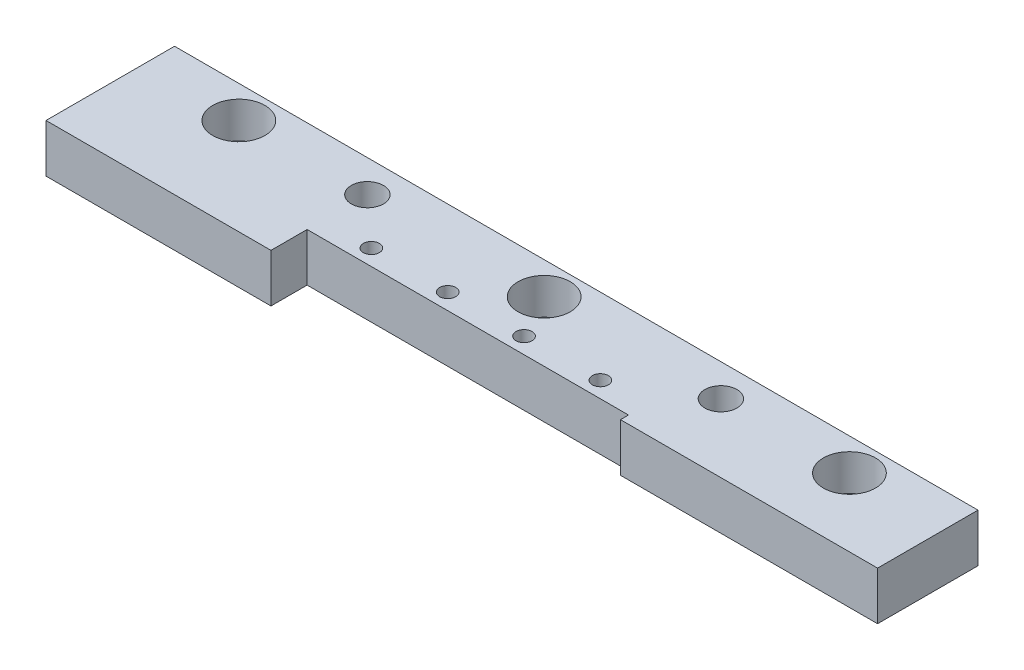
ISO-10303-21;
HEADER;
FILE_DESCRIPTION(('STEP AP214'),'2;1');
FILE_NAME('part.step','',(''),(''),'','','');
FILE_SCHEMA(('AUTOMOTIVE_DESIGN { 1 0 10303 214 1 1 1 1 }'));
ENDSEC;
DATA;
#1=APPLICATION_CONTEXT('core data for automotive mechanical design processes');
#2=APPLICATION_PROTOCOL_DEFINITION('international standard','automotive_design',2000,#1);
#3=PRODUCT_CONTEXT('',#1,'mechanical');
#4=PRODUCT('Part','Part','',(#3));
#5=PRODUCT_RELATED_PRODUCT_CATEGORY('part','',(#4));
#6=PRODUCT_DEFINITION_FORMATION('','',#4);
#7=PRODUCT_DEFINITION_CONTEXT('part definition',#1,'design');
#8=PRODUCT_DEFINITION('design','',#6,#7);
#9=PRODUCT_DEFINITION_SHAPE('','',#8);
#10=(LENGTH_UNIT() NAMED_UNIT(*) SI_UNIT(.MILLI.,.METRE.));
#11=(NAMED_UNIT(*) PLANE_ANGLE_UNIT() SI_UNIT($,.RADIAN.));
#12=(NAMED_UNIT(*) SI_UNIT($,.STERADIAN.) SOLID_ANGLE_UNIT());
#13=UNCERTAINTY_MEASURE_WITH_UNIT(LENGTH_MEASURE(1.E-05),#10,'distance_accuracy_value','');
#14=(GEOMETRIC_REPRESENTATION_CONTEXT(3) GLOBAL_UNCERTAINTY_ASSIGNED_CONTEXT((#13)) GLOBAL_UNIT_ASSIGNED_CONTEXT((#10,
#11,#12)) REPRESENTATION_CONTEXT('',''));
#15=CARTESIAN_POINT('',(0.,0.,0.));
#16=DIRECTION('',(0.,0.,1.));
#17=DIRECTION('',(1.,0.,0.));
#18=AXIS2_PLACEMENT_3D('',#15,#16,#17);
#19=CARTESIAN_POINT('',(50.,-10.,4.));
#20=DIRECTION('',(0.,1.,0.));
#21=DIRECTION('',(0.,0.,1.));
#22=AXIS2_PLACEMENT_3D('',#19,#20,#21);
#23=CYLINDRICAL_SURFACE('',#22,1.75);
#24=CARTESIAN_POINT('',(50.,0.,4.));
#25=DIRECTION('',(0.,1.,0.));
#26=DIRECTION('',(0.,0.,1.));
#27=AXIS2_PLACEMENT_3D('',#24,#25,#26);
#28=CIRCLE('',#27,1.75);
#29=CARTESIAN_POINT('',(50.,0.,5.75));
#30=VERTEX_POINT('',#29);
#31=EDGE_CURVE('E182',#30,#30,#28,.T.);
#32=ORIENTED_EDGE('',*,*,#31,.F.);
#33=EDGE_LOOP('',(#32));
#34=FACE_BOUND('',#33,.T.);
#35=CARTESIAN_POINT('',(50.,1.5,4.));
#36=DIRECTION('',(0.,1.,0.));
#37=DIRECTION('',(0.,0.,1.));
#38=AXIS2_PLACEMENT_3D('',#35,#36,#37);
#39=CIRCLE('',#38,1.75);
#40=CARTESIAN_POINT('',(50.,1.5,5.75));
#41=VERTEX_POINT('',#40);
#42=EDGE_CURVE('E37',#41,#41,#39,.F.);
#43=ORIENTED_EDGE('',*,*,#42,.F.);
#44=EDGE_LOOP('',(#43));
#45=FACE_BOUND('',#44,.T.);
#46=ADVANCED_FACE('F33',(#34,#45),#23,.F.);
#47=CARTESIAN_POINT('',(88.,-10.,4.));
#48=DIRECTION('',(0.,1.,0.));
#49=DIRECTION('',(0.,0.,1.));
#50=AXIS2_PLACEMENT_3D('',#47,#48,#49);
#51=CYLINDRICAL_SURFACE('',#50,1.75);
#52=CARTESIAN_POINT('',(88.,0.,4.));
#53=DIRECTION('',(0.,1.,0.));
#54=DIRECTION('',(0.,0.,1.));
#55=AXIS2_PLACEMENT_3D('',#52,#53,#54);
#56=CIRCLE('',#55,1.75);
#57=CARTESIAN_POINT('',(88.,0.,5.75));
#58=VERTEX_POINT('',#57);
#59=EDGE_CURVE('E185',#58,#58,#56,.T.);
#60=ORIENTED_EDGE('',*,*,#59,.F.);
#61=EDGE_LOOP('',(#60));
#62=FACE_BOUND('',#61,.T.);
#63=CARTESIAN_POINT('',(88.,1.5,4.));
#64=DIRECTION('',(0.,1.,0.));
#65=DIRECTION('',(0.,0.,1.));
#66=AXIS2_PLACEMENT_3D('',#63,#64,#65);
#67=CIRCLE('',#66,1.75);
#68=CARTESIAN_POINT('',(88.,1.5,5.75));
#69=VERTEX_POINT('',#68);
#70=EDGE_CURVE('E117',#69,#69,#67,.F.);
#71=ORIENTED_EDGE('',*,*,#70,.F.);
#72=EDGE_LOOP('',(#71));
#73=FACE_BOUND('',#72,.T.);
#74=ADVANCED_FACE('F264',(#62,#73),#51,.F.);
#75=CARTESIAN_POINT('',(12.,-10.,4.));
#76=DIRECTION('',(0.,1.,0.));
#77=DIRECTION('',(0.,0.,1.));
#78=AXIS2_PLACEMENT_3D('',#75,#76,#77);
#79=CYLINDRICAL_SURFACE('',#78,1.75);
#80=CARTESIAN_POINT('',(12.,0.,4.));
#81=DIRECTION('',(0.,1.,0.));
#82=DIRECTION('',(0.,0.,1.));
#83=AXIS2_PLACEMENT_3D('',#80,#81,#82);
#84=CIRCLE('',#83,1.75);
#85=CARTESIAN_POINT('',(12.,0.,5.75));
#86=VERTEX_POINT('',#85);
#87=EDGE_CURVE('E188',#86,#86,#84,.T.);
#88=ORIENTED_EDGE('',*,*,#87,.F.);
#89=EDGE_LOOP('',(#88));
#90=FACE_BOUND('',#89,.T.);
#91=CARTESIAN_POINT('',(12.,1.5,4.));
#92=DIRECTION('',(0.,1.,0.));
#93=DIRECTION('',(0.,0.,1.));
#94=AXIS2_PLACEMENT_3D('',#91,#92,#93);
#95=CIRCLE('',#94,1.75);
#96=CARTESIAN_POINT('',(12.,1.5,5.75));
#97=VERTEX_POINT('',#96);
#98=EDGE_CURVE('E114',#97,#97,#95,.F.);
#99=ORIENTED_EDGE('',*,*,#98,.F.);
#100=EDGE_LOOP('',(#99));
#101=FACE_BOUND('',#100,.T.);
#102=ADVANCED_FACE('F261',(#90,#101),#79,.F.);
#103=CARTESIAN_POINT('',(0.,0.,16.));
#104=DIRECTION('',(0.,1.,0.));
#105=DIRECTION('',(0.,0.,1.));
#106=AXIS2_PLACEMENT_3D('',#103,#104,#105);
#107=PLANE('',#106);
#108=CARTESIAN_POINT('',(62.5,0.,9.5));
#109=DIRECTION('',(0.,1.,0.));
#110=DIRECTION('',(0.,0.,1.));
#111=AXIS2_PLACEMENT_3D('',#108,#109,#110);
#112=CIRCLE('',#111,1.);
#113=CARTESIAN_POINT('',(62.5,0.,10.5));
#114=VERTEX_POINT('',#113);
#115=EDGE_CURVE('E100',#114,#114,#112,.T.);
#116=ORIENTED_EDGE('',*,*,#115,.T.);
#117=EDGE_LOOP('',(#116));
#118=FACE_BOUND('',#117,.T.);
#119=CARTESIAN_POINT('',(53.,0.,9.5));
#120=DIRECTION('',(0.,1.,0.));
#121=DIRECTION('',(0.,0.,1.));
#122=AXIS2_PLACEMENT_3D('',#119,#120,#121);
#123=CIRCLE('',#122,1.);
#124=CARTESIAN_POINT('',(53.,0.,10.5));
#125=VERTEX_POINT('',#124);
#126=EDGE_CURVE('E206',#125,#125,#123,.T.);
#127=ORIENTED_EDGE('',*,*,#126,.T.);
#128=EDGE_LOOP('',(#127));
#129=FACE_BOUND('',#128,.T.);
#130=CARTESIAN_POINT('',(43.5,0.,9.5));
#131=DIRECTION('',(0.,1.,0.));
#132=DIRECTION('',(0.,0.,1.));
#133=AXIS2_PLACEMENT_3D('',#130,#131,#132);
#134=CIRCLE('',#133,1.);
#135=CARTESIAN_POINT('',(43.5,0.,10.5));
#136=VERTEX_POINT('',#135);
#137=EDGE_CURVE('E200',#136,#136,#134,.T.);
#138=ORIENTED_EDGE('',*,*,#137,.T.);
#139=EDGE_LOOP('',(#138));
#140=FACE_BOUND('',#139,.T.);
#141=CARTESIAN_POINT('',(34.,0.,9.5));
#142=DIRECTION('',(0.,1.,0.));
#143=DIRECTION('',(0.,0.,1.));
#144=AXIS2_PLACEMENT_3D('',#141,#142,#143);
#145=CIRCLE('',#144,1.);
#146=CARTESIAN_POINT('',(34.,0.,10.5));
#147=VERTEX_POINT('',#146);
#148=EDGE_CURVE('E194',#147,#147,#145,.T.);
#149=ORIENTED_EDGE('',*,*,#148,.T.);
#150=EDGE_LOOP('',(#149));
#151=FACE_BOUND('',#150,.T.);
#152=ORIENTED_EDGE('',*,*,#87,.T.);
#153=EDGE_LOOP('',(#152));
#154=FACE_BOUND('',#153,.T.);
#155=ORIENTED_EDGE('',*,*,#59,.T.);
#156=EDGE_LOOP('',(#155));
#157=FACE_BOUND('',#156,.T.);
#158=ORIENTED_EDGE('',*,*,#31,.T.);
#159=EDGE_LOOP('',(#158));
#160=FACE_BOUND('',#159,.T.);
#161=CARTESIAN_POINT('',(28.,0.,4.));
#162=DIRECTION('',(0.,1.,0.));
#163=DIRECTION('',(0.,0.,1.));
#164=AXIS2_PLACEMENT_3D('',#161,#162,#163);
#165=CIRCLE('',#164,2.);
#166=CARTESIAN_POINT('',(28.,0.,6.));
#167=VERTEX_POINT('',#166);
#168=EDGE_CURVE('E179',#167,#167,#165,.T.);
#169=ORIENTED_EDGE('',*,*,#168,.T.);
#170=EDGE_LOOP('',(#169));
#171=FACE_BOUND('',#170,.T.);
#172=CARTESIAN_POINT('',(72.,0.,4.));
#173=DIRECTION('',(0.,1.,0.));
#174=DIRECTION('',(0.,0.,1.));
#175=AXIS2_PLACEMENT_3D('',#172,#173,#174);
#176=CIRCLE('',#175,2.);
#177=CARTESIAN_POINT('',(72.,0.,6.));
#178=VERTEX_POINT('',#177);
#179=EDGE_CURVE('E173',#178,#178,#176,.T.);
#180=ORIENTED_EDGE('',*,*,#179,.T.);
#181=EDGE_LOOP('',(#180));
#182=FACE_BOUND('',#181,.T.);
#183=DIRECTION('',(1.,0.,0.));
#184=VECTOR('',#183,1.);
#185=CARTESIAN_POINT('',(0.,0.,12.5));
#186=LINE('',#185,#184);
#187=CARTESIAN_POINT('',(68.,0.,12.5));
#188=VERTEX_POINT('',#187);
#189=CARTESIAN_POINT('',(100.,0.,12.5));
#190=VERTEX_POINT('',#189);
#191=EDGE_CURVE('E167',#188,#190,#186,.T.);
#192=ORIENTED_EDGE('',*,*,#191,.F.);
#193=DIRECTION('',(0.,0.,1.));
#194=VECTOR('',#193,1.);
#195=CARTESIAN_POINT('',(68.,0.,16.));
#196=LINE('',#195,#194);
#197=CARTESIAN_POINT('',(68.,0.,11.5));
#198=VERTEX_POINT('',#197);
#199=EDGE_CURVE('E164',#198,#188,#196,.T.);
#200=ORIENTED_EDGE('',*,*,#199,.F.);
#201=DIRECTION('',(1.,0.,0.));
#202=VECTOR('',#201,1.);
#203=CARTESIAN_POINT('',(0.,0.,11.5));
#204=LINE('',#203,#202);
#205=CARTESIAN_POINT('',(28.,0.,11.5));
#206=VERTEX_POINT('',#205);
#207=EDGE_CURVE('E161',#206,#198,#204,.T.);
#208=ORIENTED_EDGE('',*,*,#207,.F.);
#209=DIRECTION('',(0.,0.,-1.));
#210=VECTOR('',#209,1.);
#211=CARTESIAN_POINT('',(28.,0.,16.));
#212=LINE('',#211,#210);
#213=CARTESIAN_POINT('',(28.,0.,16.));
#214=VERTEX_POINT('',#213);
#215=EDGE_CURVE('E151',#214,#206,#212,.T.);
#216=ORIENTED_EDGE('',*,*,#215,.F.);
#217=DIRECTION('',(1.,0.,0.));
#218=VECTOR('',#217,1.);
#219=CARTESIAN_POINT('',(0.,0.,16.));
#220=LINE('',#219,#218);
#221=CARTESIAN_POINT('',(0.,0.,16.));
#222=VERTEX_POINT('',#221);
#223=EDGE_CURVE('E211',#222,#214,#220,.T.);
#224=ORIENTED_EDGE('',*,*,#223,.F.);
#225=DIRECTION('',(0.,0.,-1.));
#226=VECTOR('',#225,1.);
#227=CARTESIAN_POINT('',(0.,0.,16.));
#228=LINE('',#227,#226);
#229=CARTESIAN_POINT('',(0.,0.,0.));
#230=VERTEX_POINT('',#229);
#231=EDGE_CURVE('E42',#222,#230,#228,.T.);
#232=ORIENTED_EDGE('',*,*,#231,.T.);
#233=DIRECTION('',(1.,0.,0.));
#234=VECTOR('',#233,1.);
#235=CARTESIAN_POINT('',(0.,0.,0.));
#236=LINE('',#235,#234);
#237=CARTESIAN_POINT('',(100.,0.,0.));
#238=VERTEX_POINT('',#237);
#239=EDGE_CURVE('E98',#230,#238,#236,.T.);
#240=ORIENTED_EDGE('',*,*,#239,.T.);
#241=DIRECTION('',(0.,0.,-1.));
#242=VECTOR('',#241,1.);
#243=CARTESIAN_POINT('',(100.,0.,16.));
#244=LINE('',#243,#242);
#245=EDGE_CURVE('E111',#190,#238,#244,.T.);
#246=ORIENTED_EDGE('',*,*,#245,.F.);
#247=EDGE_LOOP('',(#192,#200,#208,#216,#224,#232,#240,#246));
#248=FACE_BOUND('',#247,.T.);
#249=ADVANCED_FACE('F221',(#118,#129,#140,#151,#154,#157,#160,#171,#182,#248),#107,.F.);
#250=CARTESIAN_POINT('',(100.,0.,16.));
#251=DIRECTION('',(-1.,0.,0.));
#252=DIRECTION('',(0.,0.,1.));
#253=AXIS2_PLACEMENT_3D('',#250,#251,#252);
#254=PLANE('',#253);
#255=DIRECTION('',(0.,1.,0.));
#256=VECTOR('',#255,1.);
#257=CARTESIAN_POINT('',(100.,-10.,12.5));
#258=LINE('',#257,#256);
#259=CARTESIAN_POINT('',(100.,6.,12.5));
#260=VERTEX_POINT('',#259);
#261=EDGE_CURVE('E148',#190,#260,#258,.T.);
#262=ORIENTED_EDGE('',*,*,#261,.F.);
#263=ORIENTED_EDGE('',*,*,#245,.T.);
#264=DIRECTION('',(0.,1.,0.));
#265=VECTOR('',#264,1.);
#266=CARTESIAN_POINT('',(100.,0.,0.));
#267=LINE('',#266,#265);
#268=CARTESIAN_POINT('',(100.,6.,0.));
#269=VERTEX_POINT('',#268);
#270=EDGE_CURVE('E89',#238,#269,#267,.T.);
#271=ORIENTED_EDGE('',*,*,#270,.T.);
#272=DIRECTION('',(0.,0.,-1.));
#273=VECTOR('',#272,1.);
#274=CARTESIAN_POINT('',(100.,6.,16.));
#275=LINE('',#274,#273);
#276=EDGE_CURVE('E83',#260,#269,#275,.T.);
#277=ORIENTED_EDGE('',*,*,#276,.F.);
#278=EDGE_LOOP('',(#262,#263,#271,#277));
#279=FACE_BOUND('',#278,.T.);
#280=ADVANCED_FACE('F252',(#279),#254,.F.);
#281=CARTESIAN_POINT('',(0.,6.,16.));
#282=DIRECTION('',(0.,-1.,0.));
#283=DIRECTION('',(0.,0.,-1.));
#284=AXIS2_PLACEMENT_3D('',#281,#282,#283);
#285=PLANE('',#284);
#286=CARTESIAN_POINT('',(50.,6.,4.));
#287=DIRECTION('',(0.,1.,0.));
#288=DIRECTION('',(0.,0.,1.));
#289=AXIS2_PLACEMENT_3D('',#286,#287,#288);
#290=CIRCLE('',#289,3.25);
#291=CARTESIAN_POINT('',(50.,6.,7.25));
#292=VERTEX_POINT('',#291);
#293=EDGE_CURVE('E133',#292,#292,#290,.T.);
#294=ORIENTED_EDGE('',*,*,#293,.F.);
#295=EDGE_LOOP('',(#294));
#296=FACE_BOUND('',#295,.T.);
#297=CARTESIAN_POINT('',(88.,6.,4.));
#298=DIRECTION('',(0.,1.,0.));
#299=DIRECTION('',(0.,0.,1.));
#300=AXIS2_PLACEMENT_3D('',#297,#298,#299);
#301=CIRCLE('',#300,3.25);
#302=CARTESIAN_POINT('',(88.,6.,7.25));
#303=VERTEX_POINT('',#302);
#304=EDGE_CURVE('E126',#303,#303,#301,.T.);
#305=ORIENTED_EDGE('',*,*,#304,.F.);
#306=EDGE_LOOP('',(#305));
#307=FACE_BOUND('',#306,.T.);
#308=CARTESIAN_POINT('',(12.,6.,4.));
#309=DIRECTION('',(0.,1.,0.));
#310=DIRECTION('',(0.,0.,1.));
#311=AXIS2_PLACEMENT_3D('',#308,#309,#310);
#312=CIRCLE('',#311,3.25);
#313=CARTESIAN_POINT('',(12.,6.,7.25));
#314=VERTEX_POINT('',#313);
#315=EDGE_CURVE('E119',#314,#314,#312,.T.);
#316=ORIENTED_EDGE('',*,*,#315,.F.);
#317=EDGE_LOOP('',(#316));
#318=FACE_BOUND('',#317,.T.);
#319=CARTESIAN_POINT('',(62.5,6.,9.5));
#320=DIRECTION('',(0.,1.,0.));
#321=DIRECTION('',(0.,0.,1.));
#322=AXIS2_PLACEMENT_3D('',#319,#320,#321);
#323=CIRCLE('',#322,1.);
#324=CARTESIAN_POINT('',(62.5,6.,10.5));
#325=VERTEX_POINT('',#324);
#326=EDGE_CURVE('E104',#325,#325,#323,.T.);
#327=ORIENTED_EDGE('',*,*,#326,.F.);
#328=EDGE_LOOP('',(#327));
#329=FACE_BOUND('',#328,.T.);
#330=CARTESIAN_POINT('',(53.,6.,9.5));
#331=DIRECTION('',(0.,1.,0.));
#332=DIRECTION('',(0.,0.,1.));
#333=AXIS2_PLACEMENT_3D('',#330,#331,#332);
#334=CIRCLE('',#333,1.);
#335=CARTESIAN_POINT('',(53.,6.,10.5));
#336=VERTEX_POINT('',#335);
#337=EDGE_CURVE('E203',#336,#336,#334,.T.);
#338=ORIENTED_EDGE('',*,*,#337,.F.);
#339=EDGE_LOOP('',(#338));
#340=FACE_BOUND('',#339,.T.);
#341=CARTESIAN_POINT('',(43.5,6.,9.5));
#342=DIRECTION('',(0.,1.,0.));
#343=DIRECTION('',(0.,0.,1.));
#344=AXIS2_PLACEMENT_3D('',#341,#342,#343);
#345=CIRCLE('',#344,1.);
#346=CARTESIAN_POINT('',(43.5,6.,10.5));
#347=VERTEX_POINT('',#346);
#348=EDGE_CURVE('E197',#347,#347,#345,.T.);
#349=ORIENTED_EDGE('',*,*,#348,.F.);
#350=EDGE_LOOP('',(#349));
#351=FACE_BOUND('',#350,.T.);
#352=CARTESIAN_POINT('',(34.,6.,9.5));
#353=DIRECTION('',(0.,1.,0.));
#354=DIRECTION('',(0.,0.,1.));
#355=AXIS2_PLACEMENT_3D('',#352,#353,#354);
#356=CIRCLE('',#355,1.);
#357=CARTESIAN_POINT('',(34.,6.,10.5));
#358=VERTEX_POINT('',#357);
#359=EDGE_CURVE('E191',#358,#358,#356,.T.);
#360=ORIENTED_EDGE('',*,*,#359,.F.);
#361=EDGE_LOOP('',(#360));
#362=FACE_BOUND('',#361,.T.);
#363=CARTESIAN_POINT('',(28.,6.,4.));
#364=DIRECTION('',(0.,1.,0.));
#365=DIRECTION('',(0.,0.,1.));
#366=AXIS2_PLACEMENT_3D('',#363,#364,#365);
#367=CIRCLE('',#366,2.);
#368=CARTESIAN_POINT('',(28.,6.,6.));
#369=VERTEX_POINT('',#368);
#370=EDGE_CURVE('E176',#369,#369,#367,.T.);
#371=ORIENTED_EDGE('',*,*,#370,.F.);
#372=EDGE_LOOP('',(#371));
#373=FACE_BOUND('',#372,.T.);
#374=CARTESIAN_POINT('',(72.,6.,4.));
#375=DIRECTION('',(0.,1.,0.));
#376=DIRECTION('',(0.,0.,1.));
#377=AXIS2_PLACEMENT_3D('',#374,#375,#376);
#378=CIRCLE('',#377,2.);
#379=CARTESIAN_POINT('',(72.,6.,6.));
#380=VERTEX_POINT('',#379);
#381=EDGE_CURVE('E170',#380,#380,#378,.T.);
#382=ORIENTED_EDGE('',*,*,#381,.F.);
#383=EDGE_LOOP('',(#382));
#384=FACE_BOUND('',#383,.T.);
#385=DIRECTION('',(1.,0.,0.));
#386=VECTOR('',#385,1.);
#387=CARTESIAN_POINT('',(68.,6.,12.5));
#388=LINE('',#387,#386);
#389=CARTESIAN_POINT('',(68.,6.,12.5));
#390=VERTEX_POINT('',#389);
#391=EDGE_CURVE('E145',#390,#260,#388,.T.);
#392=ORIENTED_EDGE('',*,*,#391,.T.);
#393=ORIENTED_EDGE('',*,*,#276,.T.);
#394=DIRECTION('',(-1.,0.,0.));
#395=VECTOR('',#394,1.);
#396=CARTESIAN_POINT('',(0.,6.,0.));
#397=LINE('',#396,#395);
#398=CARTESIAN_POINT('',(0.,6.,0.));
#399=VERTEX_POINT('',#398);
#400=EDGE_CURVE('E76',#269,#399,#397,.T.);
#401=ORIENTED_EDGE('',*,*,#400,.T.);
#402=DIRECTION('',(0.,0.,-1.));
#403=VECTOR('',#402,1.);
#404=CARTESIAN_POINT('',(0.,6.,16.));
#405=LINE('',#404,#403);
#406=CARTESIAN_POINT('',(0.,6.,16.));
#407=VERTEX_POINT('',#406);
#408=EDGE_CURVE('E80',#407,#399,#405,.T.);
#409=ORIENTED_EDGE('',*,*,#408,.F.);
#410=DIRECTION('',(-1.,0.,0.));
#411=VECTOR('',#410,1.);
#412=CARTESIAN_POINT('',(0.,6.,16.));
#413=LINE('',#412,#411);
#414=CARTESIAN_POINT('',(28.,6.,16.));
#415=VERTEX_POINT('',#414);
#416=EDGE_CURVE('E57',#415,#407,#413,.T.);
#417=ORIENTED_EDGE('',*,*,#416,.F.);
#418=DIRECTION('',(0.,0.,-1.));
#419=VECTOR('',#418,1.);
#420=CARTESIAN_POINT('',(28.,6.,16.));
#421=LINE('',#420,#419);
#422=CARTESIAN_POINT('',(28.,6.,11.5));
#423=VERTEX_POINT('',#422);
#424=EDGE_CURVE('E49',#415,#423,#421,.T.);
#425=ORIENTED_EDGE('',*,*,#424,.T.);
#426=DIRECTION('',(1.,0.,0.));
#427=VECTOR('',#426,1.);
#428=CARTESIAN_POINT('',(28.,6.,11.5));
#429=LINE('',#428,#427);
#430=CARTESIAN_POINT('',(68.,6.,11.5));
#431=VERTEX_POINT('',#430);
#432=EDGE_CURVE('E139',#423,#431,#429,.T.);
#433=ORIENTED_EDGE('',*,*,#432,.T.);
#434=DIRECTION('',(0.,0.,1.));
#435=VECTOR('',#434,1.);
#436=CARTESIAN_POINT('',(68.,6.,11.5));
#437=LINE('',#436,#435);
#438=EDGE_CURVE('E142',#431,#390,#437,.T.);
#439=ORIENTED_EDGE('',*,*,#438,.T.);
#440=EDGE_LOOP('',(#392,#393,#401,#409,#417,#425,#433,#439));
#441=FACE_BOUND('',#440,.T.);
#442=ADVANCED_FACE('F79',(#296,#307,#318,#329,#340,#351,#362,#373,#384,#441),#285,.F.);
#443=CARTESIAN_POINT('',(0.,6.,16.));
#444=DIRECTION('',(0.,0.,-1.));
#445=DIRECTION('',(-1.,0.,0.));
#446=AXIS2_PLACEMENT_3D('',#443,#444,#445);
#447=PLANE('',#446);
#448=DIRECTION('',(0.,-1.,0.));
#449=VECTOR('',#448,1.);
#450=CARTESIAN_POINT('',(28.,6.,16.));
#451=LINE('',#450,#449);
#452=EDGE_CURVE('E12',#415,#214,#451,.T.);
#453=ORIENTED_EDGE('',*,*,#452,.F.);
#454=ORIENTED_EDGE('',*,*,#416,.T.);
#455=DIRECTION('',(0.,-1.,0.));
#456=VECTOR('',#455,1.);
#457=CARTESIAN_POINT('',(0.,0.,16.));
#458=LINE('',#457,#456);
#459=EDGE_CURVE('E88',#407,#222,#458,.T.);
#460=ORIENTED_EDGE('',*,*,#459,.T.);
#461=ORIENTED_EDGE('',*,*,#223,.T.);
#462=EDGE_LOOP('',(#453,#454,#460,#461));
#463=FACE_BOUND('',#462,.T.);
#464=ADVANCED_FACE('F214',(#463),#447,.F.);
#465=CARTESIAN_POINT('',(0.,0.,16.));
#466=DIRECTION('',(1.,0.,0.));
#467=DIRECTION('',(0.,0.,-1.));
#468=AXIS2_PLACEMENT_3D('',#465,#466,#467);
#469=PLANE('',#468);
#470=DIRECTION('',(0.,-1.,0.));
#471=VECTOR('',#470,1.);
#472=CARTESIAN_POINT('',(0.,0.,0.));
#473=LINE('',#472,#471);
#474=EDGE_CURVE('E94',#399,#230,#473,.T.);
#475=ORIENTED_EDGE('',*,*,#474,.T.);
#476=ORIENTED_EDGE('',*,*,#231,.F.);
#477=ORIENTED_EDGE('',*,*,#459,.F.);
#478=ORIENTED_EDGE('',*,*,#408,.T.);
#479=EDGE_LOOP('',(#475,#476,#477,#478));
#480=FACE_BOUND('',#479,.T.);
#481=ADVANCED_FACE('F35',(#480),#469,.F.);
#482=CARTESIAN_POINT('',(0.,6.,0.));
#483=DIRECTION('',(0.,0.,-1.));
#484=DIRECTION('',(-1.,0.,0.));
#485=AXIS2_PLACEMENT_3D('',#482,#483,#484);
#486=PLANE('',#485);
#487=ORIENTED_EDGE('',*,*,#474,.F.);
#488=ORIENTED_EDGE('',*,*,#400,.F.);
#489=ORIENTED_EDGE('',*,*,#270,.F.);
#490=ORIENTED_EDGE('',*,*,#239,.F.);
#491=EDGE_LOOP('',(#487,#488,#489,#490));
#492=FACE_BOUND('',#491,.T.);
#493=ADVANCED_FACE('F96',(#492),#486,.T.);
#494=CARTESIAN_POINT('',(62.5,-10.,9.5));
#495=DIRECTION('',(0.,1.,0.));
#496=DIRECTION('',(0.,0.,1.));
#497=AXIS2_PLACEMENT_3D('',#494,#495,#496);
#498=CYLINDRICAL_SURFACE('',#497,1.);
#499=ORIENTED_EDGE('',*,*,#326,.T.);
#500=EDGE_LOOP('',(#499));
#501=FACE_BOUND('',#500,.T.);
#502=ORIENTED_EDGE('',*,*,#115,.F.);
#503=EDGE_LOOP('',(#502));
#504=FACE_BOUND('',#503,.T.);
#505=ADVANCED_FACE('F292',(#501,#504),#498,.F.);
#506=CARTESIAN_POINT('',(53.,-10.,9.5));
#507=DIRECTION('',(0.,1.,0.));
#508=DIRECTION('',(0.,0.,1.));
#509=AXIS2_PLACEMENT_3D('',#506,#507,#508);
#510=CYLINDRICAL_SURFACE('',#509,1.);
#511=ORIENTED_EDGE('',*,*,#337,.T.);
#512=EDGE_LOOP('',(#511));
#513=FACE_BOUND('',#512,.T.);
#514=ORIENTED_EDGE('',*,*,#126,.F.);
#515=EDGE_LOOP('',(#514));
#516=FACE_BOUND('',#515,.T.);
#517=ADVANCED_FACE('F288',(#513,#516),#510,.F.);
#518=CARTESIAN_POINT('',(43.5,-10.,9.5));
#519=DIRECTION('',(0.,1.,0.));
#520=DIRECTION('',(0.,0.,1.));
#521=AXIS2_PLACEMENT_3D('',#518,#519,#520);
#522=CYLINDRICAL_SURFACE('',#521,1.);
#523=ORIENTED_EDGE('',*,*,#348,.T.);
#524=EDGE_LOOP('',(#523));
#525=FACE_BOUND('',#524,.T.);
#526=ORIENTED_EDGE('',*,*,#137,.F.);
#527=EDGE_LOOP('',(#526));
#528=FACE_BOUND('',#527,.T.);
#529=ADVANCED_FACE('F284',(#525,#528),#522,.F.);
#530=CARTESIAN_POINT('',(34.,-10.,9.5));
#531=DIRECTION('',(0.,1.,0.));
#532=DIRECTION('',(0.,0.,1.));
#533=AXIS2_PLACEMENT_3D('',#530,#531,#532);
#534=CYLINDRICAL_SURFACE('',#533,1.);
#535=ORIENTED_EDGE('',*,*,#359,.T.);
#536=EDGE_LOOP('',(#535));
#537=FACE_BOUND('',#536,.T.);
#538=ORIENTED_EDGE('',*,*,#148,.F.);
#539=EDGE_LOOP('',(#538));
#540=FACE_BOUND('',#539,.T.);
#541=ADVANCED_FACE('F281',(#537,#540),#534,.F.);
#542=CARTESIAN_POINT('',(28.,-10.,4.));
#543=DIRECTION('',(0.,1.,0.));
#544=DIRECTION('',(0.,0.,1.));
#545=AXIS2_PLACEMENT_3D('',#542,#543,#544);
#546=CYLINDRICAL_SURFACE('',#545,2.);
#547=ORIENTED_EDGE('',*,*,#370,.T.);
#548=EDGE_LOOP('',(#547));
#549=FACE_BOUND('',#548,.T.);
#550=ORIENTED_EDGE('',*,*,#168,.F.);
#551=EDGE_LOOP('',(#550));
#552=FACE_BOUND('',#551,.T.);
#553=ADVANCED_FACE('F275',(#549,#552),#546,.F.);
#554=CARTESIAN_POINT('',(72.,-10.,4.));
#555=DIRECTION('',(0.,1.,0.));
#556=DIRECTION('',(0.,0.,1.));
#557=AXIS2_PLACEMENT_3D('',#554,#555,#556);
#558=CYLINDRICAL_SURFACE('',#557,2.);
#559=ORIENTED_EDGE('',*,*,#381,.T.);
#560=EDGE_LOOP('',(#559));
#561=FACE_BOUND('',#560,.T.);
#562=ORIENTED_EDGE('',*,*,#179,.F.);
#563=EDGE_LOOP('',(#562));
#564=FACE_BOUND('',#563,.T.);
#565=ADVANCED_FACE('F389',(#561,#564),#558,.F.);
#566=CARTESIAN_POINT('',(68.,-10.,12.5));
#567=DIRECTION('',(0.,0.,1.));
#568=DIRECTION('',(1.,0.,0.));
#569=AXIS2_PLACEMENT_3D('',#566,#567,#568);
#570=PLANE('',#569);
#571=ORIENTED_EDGE('',*,*,#191,.T.);
#572=ORIENTED_EDGE('',*,*,#261,.T.);
#573=ORIENTED_EDGE('',*,*,#391,.F.);
#574=DIRECTION('',(0.,1.,0.));
#575=VECTOR('',#574,1.);
#576=CARTESIAN_POINT('',(68.,-10.,12.5));
#577=LINE('',#576,#575);
#578=EDGE_CURVE('E152',#188,#390,#577,.T.);
#579=ORIENTED_EDGE('',*,*,#578,.F.);
#580=EDGE_LOOP('',(#571,#572,#573,#579));
#581=FACE_BOUND('',#580,.T.);
#582=ADVANCED_FACE('F248',(#581),#570,.T.);
#583=CARTESIAN_POINT('',(68.,-10.,11.5));
#584=DIRECTION('',(-1.,0.,0.));
#585=DIRECTION('',(0.,0.,1.));
#586=AXIS2_PLACEMENT_3D('',#583,#584,#585);
#587=PLANE('',#586);
#588=ORIENTED_EDGE('',*,*,#199,.T.);
#589=ORIENTED_EDGE('',*,*,#578,.T.);
#590=ORIENTED_EDGE('',*,*,#438,.F.);
#591=DIRECTION('',(0.,1.,0.));
#592=VECTOR('',#591,1.);
#593=CARTESIAN_POINT('',(68.,-10.,11.5));
#594=LINE('',#593,#592);
#595=EDGE_CURVE('E155',#198,#431,#594,.T.);
#596=ORIENTED_EDGE('',*,*,#595,.F.);
#597=EDGE_LOOP('',(#588,#589,#590,#596));
#598=FACE_BOUND('',#597,.T.);
#599=ADVANCED_FACE('F245',(#598),#587,.T.);
#600=CARTESIAN_POINT('',(28.,-10.,11.5));
#601=DIRECTION('',(0.,0.,1.));
#602=DIRECTION('',(1.,0.,0.));
#603=AXIS2_PLACEMENT_3D('',#600,#601,#602);
#604=PLANE('',#603);
#605=ORIENTED_EDGE('',*,*,#207,.T.);
#606=ORIENTED_EDGE('',*,*,#595,.T.);
#607=ORIENTED_EDGE('',*,*,#432,.F.);
#608=DIRECTION('',(0.,1.,0.));
#609=VECTOR('',#608,1.);
#610=CARTESIAN_POINT('',(28.,-10.,11.5));
#611=LINE('',#610,#609);
#612=EDGE_CURVE('E147',#206,#423,#611,.T.);
#613=ORIENTED_EDGE('',*,*,#612,.F.);
#614=EDGE_LOOP('',(#605,#606,#607,#613));
#615=FACE_BOUND('',#614,.T.);
#616=ADVANCED_FACE('F231',(#615),#604,.T.);
#617=CARTESIAN_POINT('',(28.,-10.,16.));
#618=DIRECTION('',(1.,0.,0.));
#619=DIRECTION('',(0.,0.,-1.));
#620=AXIS2_PLACEMENT_3D('',#617,#618,#619);
#621=PLANE('',#620);
#622=ORIENTED_EDGE('',*,*,#215,.T.);
#623=ORIENTED_EDGE('',*,*,#612,.T.);
#624=ORIENTED_EDGE('',*,*,#424,.F.);
#625=ORIENTED_EDGE('',*,*,#452,.T.);
#626=EDGE_LOOP('',(#622,#623,#624,#625));
#627=FACE_BOUND('',#626,.T.);
#628=ADVANCED_FACE('F225',(#627),#621,.T.);
#629=CARTESIAN_POINT('',(12.,1.5,4.));
#630=DIRECTION('',(0.,1.,0.));
#631=DIRECTION('',(0.,0.,1.));
#632=AXIS2_PLACEMENT_3D('',#629,#630,#631);
#633=PLANE('',#632);
#634=CARTESIAN_POINT('',(12.,1.5,4.));
#635=DIRECTION('',(0.,1.,0.));
#636=DIRECTION('',(0.,0.,1.));
#637=AXIS2_PLACEMENT_3D('',#634,#635,#636);
#638=CIRCLE('',#637,3.25);
#639=CARTESIAN_POINT('',(12.,1.5,7.25));
#640=VERTEX_POINT('',#639);
#641=EDGE_CURVE('E116',#640,#640,#638,.T.);
#642=ORIENTED_EDGE('',*,*,#641,.T.);
#643=EDGE_LOOP('',(#642));
#644=FACE_BOUND('',#643,.T.);
#645=ORIENTED_EDGE('',*,*,#98,.T.);
#646=EDGE_LOOP('',(#645));
#647=FACE_BOUND('',#646,.T.);
#648=ADVANCED_FACE('F324',(#644,#647),#633,.T.);
#649=CARTESIAN_POINT('',(12.,1.5,4.));
#650=DIRECTION('',(0.,1.,0.));
#651=DIRECTION('',(0.,0.,1.));
#652=AXIS2_PLACEMENT_3D('',#649,#650,#651);
#653=CYLINDRICAL_SURFACE('',#652,3.25);
#654=ORIENTED_EDGE('',*,*,#641,.F.);
#655=EDGE_LOOP('',(#654));
#656=FACE_BOUND('',#655,.T.);
#657=ORIENTED_EDGE('',*,*,#315,.T.);
#658=EDGE_LOOP('',(#657));
#659=FACE_BOUND('',#658,.T.);
#660=ADVANCED_FACE('F329',(#656,#659),#653,.F.);
#661=CARTESIAN_POINT('',(88.,1.5,4.));
#662=DIRECTION('',(0.,1.,0.));
#663=DIRECTION('',(0.,0.,1.));
#664=AXIS2_PLACEMENT_3D('',#661,#662,#663);
#665=PLANE('',#664);
#666=CARTESIAN_POINT('',(88.,1.5,4.));
#667=DIRECTION('',(0.,1.,0.));
#668=DIRECTION('',(0.,0.,1.));
#669=AXIS2_PLACEMENT_3D('',#666,#667,#668);
#670=CIRCLE('',#669,3.25);
#671=CARTESIAN_POINT('',(88.,1.5,7.25));
#672=VERTEX_POINT('',#671);
#673=EDGE_CURVE('E120',#672,#672,#670,.T.);
#674=ORIENTED_EDGE('',*,*,#673,.T.);
#675=EDGE_LOOP('',(#674));
#676=FACE_BOUND('',#675,.T.);
#677=ORIENTED_EDGE('',*,*,#70,.T.);
#678=EDGE_LOOP('',(#677));
#679=FACE_BOUND('',#678,.T.);
#680=ADVANCED_FACE('F341',(#676,#679),#665,.T.);
#681=CARTESIAN_POINT('',(88.,1.5,4.));
#682=DIRECTION('',(0.,1.,0.));
#683=DIRECTION('',(0.,0.,1.));
#684=AXIS2_PLACEMENT_3D('',#681,#682,#683);
#685=CYLINDRICAL_SURFACE('',#684,3.25);
#686=ORIENTED_EDGE('',*,*,#673,.F.);
#687=EDGE_LOOP('',(#686));
#688=FACE_BOUND('',#687,.T.);
#689=ORIENTED_EDGE('',*,*,#304,.T.);
#690=EDGE_LOOP('',(#689));
#691=FACE_BOUND('',#690,.T.);
#692=ADVANCED_FACE('F351',(#688,#691),#685,.F.);
#693=CARTESIAN_POINT('',(50.,1.5,4.));
#694=DIRECTION('',(0.,1.,0.));
#695=DIRECTION('',(0.,0.,1.));
#696=AXIS2_PLACEMENT_3D('',#693,#694,#695);
#697=PLANE('',#696);
#698=CARTESIAN_POINT('',(50.,1.5,4.));
#699=DIRECTION('',(0.,1.,0.));
#700=DIRECTION('',(0.,0.,1.));
#701=AXIS2_PLACEMENT_3D('',#698,#699,#700);
#702=CIRCLE('',#701,3.25);
#703=CARTESIAN_POINT('',(50.,1.5,7.25));
#704=VERTEX_POINT('',#703);
#705=EDGE_CURVE('E496',#704,#704,#702,.T.);
#706=ORIENTED_EDGE('',*,*,#705,.T.);
#707=EDGE_LOOP('',(#706));
#708=FACE_BOUND('',#707,.T.);
#709=ORIENTED_EDGE('',*,*,#42,.T.);
#710=EDGE_LOOP('',(#709));
#711=FACE_BOUND('',#710,.T.);
#712=ADVANCED_FACE('F360',(#708,#711),#697,.T.);
#713=CARTESIAN_POINT('',(50.,1.5,4.));
#714=DIRECTION('',(0.,1.,0.));
#715=DIRECTION('',(0.,0.,1.));
#716=AXIS2_PLACEMENT_3D('',#713,#714,#715);
#717=CYLINDRICAL_SURFACE('',#716,3.25);
#718=ORIENTED_EDGE('',*,*,#705,.F.);
#719=EDGE_LOOP('',(#718));
#720=FACE_BOUND('',#719,.T.);
#721=ORIENTED_EDGE('',*,*,#293,.T.);
#722=EDGE_LOOP('',(#721));
#723=FACE_BOUND('',#722,.T.);
#724=ADVANCED_FACE('F370',(#720,#723),#717,.F.);
#725=CLOSED_SHELL('',(#46,#74,#102,#249,#280,#442,#464,#481,#493,#505,#517,#529,#541,#553,#565,
#582,#599,#616,#628,#648,#660,#680,#692,#712,#724));
#726=MANIFOLD_SOLID_BREP('B2',#725);
#727=ADVANCED_BREP_SHAPE_REPRESENTATION('',(#18,#726),#14);
#728=SHAPE_DEFINITION_REPRESENTATION(#9,#727);
ENDSEC;
END-ISO-10303-21;
